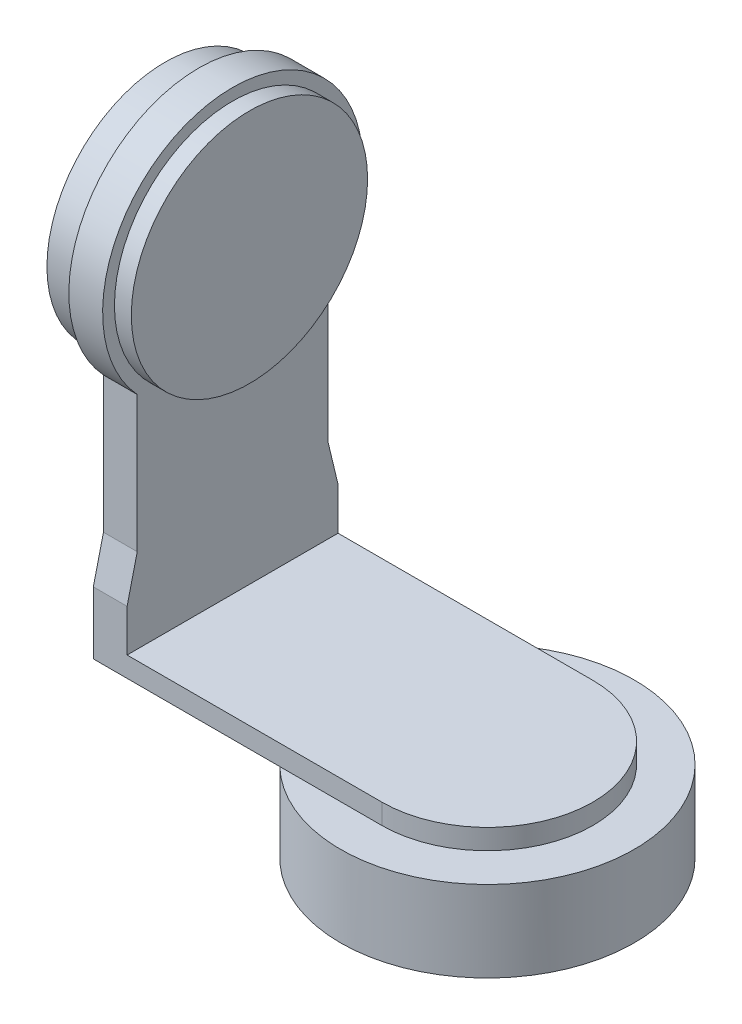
ISO-10303-21;
HEADER;
FILE_DESCRIPTION(('STEP AP214'),'2;1');
FILE_NAME('part.step','',(''),(''),'','','');
FILE_SCHEMA(('AUTOMOTIVE_DESIGN { 1 0 10303 214 1 1 1 1 }'));
ENDSEC;
DATA;
#1=APPLICATION_CONTEXT('core data for automotive mechanical design processes');
#2=APPLICATION_PROTOCOL_DEFINITION('international standard','automotive_design',2000,#1);
#3=PRODUCT_CONTEXT('',#1,'mechanical');
#4=PRODUCT('Part','Part','',(#3));
#5=PRODUCT_RELATED_PRODUCT_CATEGORY('part','',(#4));
#6=PRODUCT_DEFINITION_FORMATION('','',#4);
#7=PRODUCT_DEFINITION_CONTEXT('part definition',#1,'design');
#8=PRODUCT_DEFINITION('design','',#6,#7);
#9=PRODUCT_DEFINITION_SHAPE('','',#8);
#10=(LENGTH_UNIT() NAMED_UNIT(*) SI_UNIT(.MILLI.,.METRE.));
#11=(NAMED_UNIT(*) PLANE_ANGLE_UNIT() SI_UNIT($,.RADIAN.));
#12=(NAMED_UNIT(*) SI_UNIT($,.STERADIAN.) SOLID_ANGLE_UNIT());
#13=UNCERTAINTY_MEASURE_WITH_UNIT(LENGTH_MEASURE(1.E-05),#10,'distance_accuracy_value','');
#14=(GEOMETRIC_REPRESENTATION_CONTEXT(3) GLOBAL_UNCERTAINTY_ASSIGNED_CONTEXT((#13)) GLOBAL_UNIT_ASSIGNED_CONTEXT((#10,
#11,#12)) REPRESENTATION_CONTEXT('',''));
#15=CARTESIAN_POINT('',(0.,0.,0.));
#16=DIRECTION('',(0.,0.,1.));
#17=DIRECTION('',(1.,0.,0.));
#18=AXIS2_PLACEMENT_3D('',#15,#16,#17);
#19=CARTESIAN_POINT('',(0.,12.,0.));
#20=DIRECTION('',(0.,1.,0.));
#21=DIRECTION('',(0.,0.,1.));
#22=AXIS2_PLACEMENT_3D('',#19,#20,#21);
#23=PLANE('',#22);
#24=DIRECTION('',(-1.,0.,0.));
#25=VECTOR('',#24,1.);
#26=CARTESIAN_POINT('',(-34.2,12.,-12.5));
#27=LINE('',#26,#25);
#28=CARTESIAN_POINT('',(0.,12.,-12.5));
#29=VERTEX_POINT('',#28);
#30=CARTESIAN_POINT('',(-30.2,12.,-12.5));
#31=VERTEX_POINT('',#30);
#32=EDGE_CURVE('E183',#29,#31,#27,.T.);
#33=ORIENTED_EDGE('',*,*,#32,.T.);
#34=DIRECTION('',(0.,0.,1.));
#35=VECTOR('',#34,1.);
#36=CARTESIAN_POINT('',(-30.2,12.,12.5));
#37=LINE('',#36,#35);
#38=CARTESIAN_POINT('',(-30.2,12.,12.5));
#39=VERTEX_POINT('',#38);
#40=EDGE_CURVE('E154',#31,#39,#37,.T.);
#41=ORIENTED_EDGE('',*,*,#40,.T.);
#42=DIRECTION('',(1.,0.,0.));
#43=VECTOR('',#42,1.);
#44=CARTESIAN_POINT('',(0.,12.,12.5));
#45=LINE('',#44,#43);
#46=CARTESIAN_POINT('',(0.,12.,12.5));
#47=VERTEX_POINT('',#46);
#48=EDGE_CURVE('E187',#39,#47,#45,.T.);
#49=ORIENTED_EDGE('',*,*,#48,.T.);
#50=CARTESIAN_POINT('',(0.,12.,0.));
#51=DIRECTION('',(0.,1.,0.));
#52=DIRECTION('',(0.,0.,1.));
#53=AXIS2_PLACEMENT_3D('',#50,#51,#52);
#54=CIRCLE('',#53,12.5);
#55=EDGE_CURVE('E180',#47,#29,#54,.T.);
#56=ORIENTED_EDGE('',*,*,#55,.T.);
#57=EDGE_LOOP('',(#33,#41,#49,#56));
#58=FACE_BOUND('',#57,.T.);
#59=ADVANCED_FACE('F33',(#58),#23,.T.);
#60=CARTESIAN_POINT('',(0.,9.6,0.));
#61=DIRECTION('',(0.,-1.,0.));
#62=DIRECTION('',(0.,0.,-1.));
#63=AXIS2_PLACEMENT_3D('',#60,#61,#62);
#64=CYLINDRICAL_SURFACE('',#63,17.4);
#65=CARTESIAN_POINT('',(0.,9.6,0.));
#66=DIRECTION('',(0.,1.,0.));
#67=DIRECTION('',(0.,0.,1.));
#68=AXIS2_PLACEMENT_3D('',#65,#66,#67);
#69=CIRCLE('',#68,17.4);
#70=CARTESIAN_POINT('',(-12.1041315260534,9.6,-12.5));
#71=VERTEX_POINT('',#70);
#72=CARTESIAN_POINT('',(-12.1041315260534,9.6,12.5));
#73=VERTEX_POINT('',#72);
#74=EDGE_CURVE('E212',#71,#73,#69,.T.);
#75=ORIENTED_EDGE('',*,*,#74,.F.);
#76=EDGE_CURVE('E214',#73,#71,#69,.T.);
#77=ORIENTED_EDGE('',*,*,#76,.F.);
#78=EDGE_LOOP('',(#75,#77));
#79=FACE_BOUND('',#78,.T.);
#80=CARTESIAN_POINT('',(0.,0.,0.));
#81=DIRECTION('',(0.,1.,0.));
#82=DIRECTION('',(0.,0.,1.));
#83=AXIS2_PLACEMENT_3D('',#80,#81,#82);
#84=CIRCLE('',#83,17.4);
#85=CARTESIAN_POINT('',(0.,0.,17.4));
#86=VERTEX_POINT('',#85);
#87=EDGE_CURVE('E211',#86,#86,#84,.T.);
#88=ORIENTED_EDGE('',*,*,#87,.T.);
#89=EDGE_LOOP('',(#88));
#90=FACE_BOUND('',#89,.T.);
#91=ADVANCED_FACE('F35',(#79,#90),#64,.T.);
#92=CARTESIAN_POINT('',(0.,9.6,0.));
#93=DIRECTION('',(0.,1.,0.));
#94=DIRECTION('',(0.,0.,1.));
#95=AXIS2_PLACEMENT_3D('',#92,#93,#94);
#96=PLANE('',#95);
#97=DIRECTION('',(1.,0.,0.));
#98=VECTOR('',#97,1.);
#99=CARTESIAN_POINT('',(0.,9.6,12.5));
#100=LINE('',#99,#98);
#101=CARTESIAN_POINT('',(0.,9.6,12.5));
#102=VERTEX_POINT('',#101);
#103=EDGE_CURVE('E199',#73,#102,#100,.T.);
#104=ORIENTED_EDGE('',*,*,#103,.F.);
#105=ORIENTED_EDGE('',*,*,#76,.T.);
#106=DIRECTION('',(-1.,0.,0.));
#107=VECTOR('',#106,1.);
#108=CARTESIAN_POINT('',(-34.2,9.6,-12.5));
#109=LINE('',#108,#107);
#110=CARTESIAN_POINT('',(0.,9.6,-12.5));
#111=VERTEX_POINT('',#110);
#112=EDGE_CURVE('E192',#111,#71,#109,.T.);
#113=ORIENTED_EDGE('',*,*,#112,.F.);
#114=CARTESIAN_POINT('',(0.,9.6,0.));
#115=DIRECTION('',(0.,1.,0.));
#116=DIRECTION('',(0.,0.,1.));
#117=AXIS2_PLACEMENT_3D('',#114,#115,#116);
#118=CIRCLE('',#117,12.5);
#119=EDGE_CURVE('E56',#102,#111,#118,.T.);
#120=ORIENTED_EDGE('',*,*,#119,.F.);
#121=EDGE_LOOP('',(#104,#105,#113,#120));
#122=FACE_BOUND('',#121,.T.);
#123=ADVANCED_FACE('F221',(#122),#96,.T.);
#124=CARTESIAN_POINT('',(0.,0.,0.));
#125=DIRECTION('',(0.,1.,0.));
#126=DIRECTION('',(0.,0.,1.));
#127=AXIS2_PLACEMENT_3D('',#124,#125,#126);
#128=PLANE('',#127);
#129=ORIENTED_EDGE('',*,*,#87,.F.);
#130=EDGE_LOOP('',(#129));
#131=FACE_BOUND('',#130,.T.);
#132=ADVANCED_FACE('F266',(#131),#128,.F.);
#133=CARTESIAN_POINT('',(0.,9.6,0.));
#134=DIRECTION('',(0.,1.,0.));
#135=DIRECTION('',(0.,0.,1.));
#136=AXIS2_PLACEMENT_3D('',#133,#134,#135);
#137=PLANE('',#136);
#138=CARTESIAN_POINT('',(-34.2,9.6,-12.5));
#139=VERTEX_POINT('',#138);
#140=EDGE_CURVE('E191',#71,#139,#109,.T.);
#141=ORIENTED_EDGE('',*,*,#140,.F.);
#142=ORIENTED_EDGE('',*,*,#74,.T.);
#143=CARTESIAN_POINT('',(-34.2,9.6,12.5));
#144=VERTEX_POINT('',#143);
#145=EDGE_CURVE('E184',#144,#73,#100,.T.);
#146=ORIENTED_EDGE('',*,*,#145,.F.);
#147=DIRECTION('',(0.,0.,1.));
#148=VECTOR('',#147,1.);
#149=CARTESIAN_POINT('',(-34.2,9.6,12.5));
#150=LINE('',#149,#148);
#151=EDGE_CURVE('E195',#139,#144,#150,.T.);
#152=ORIENTED_EDGE('',*,*,#151,.F.);
#153=EDGE_LOOP('',(#141,#142,#146,#152));
#154=FACE_BOUND('',#153,.T.);
#155=ADVANCED_FACE('F225',(#154),#137,.F.);
#156=CARTESIAN_POINT('',(0.,12.,0.));
#157=DIRECTION('',(0.,-1.,0.));
#158=DIRECTION('',(0.,0.,-1.));
#159=AXIS2_PLACEMENT_3D('',#156,#157,#158);
#160=CYLINDRICAL_SURFACE('',#159,12.5);
#161=ORIENTED_EDGE('',*,*,#119,.T.);
#162=DIRECTION('',(0.,-1.,0.));
#163=VECTOR('',#162,1.);
#164=CARTESIAN_POINT('',(0.,12.,-12.5));
#165=LINE('',#164,#163);
#166=EDGE_CURVE('E208',#29,#111,#165,.T.);
#167=ORIENTED_EDGE('',*,*,#166,.F.);
#168=ORIENTED_EDGE('',*,*,#55,.F.);
#169=DIRECTION('',(0.,-1.,0.));
#170=VECTOR('',#169,1.);
#171=CARTESIAN_POINT('',(0.,12.,12.5));
#172=LINE('',#171,#170);
#173=EDGE_CURVE('E189',#47,#102,#172,.T.);
#174=ORIENTED_EDGE('',*,*,#173,.T.);
#175=EDGE_LOOP('',(#161,#167,#168,#174));
#176=FACE_BOUND('',#175,.T.);
#177=ADVANCED_FACE('F232',(#176),#160,.T.);
#178=CARTESIAN_POINT('',(-34.2,12.,-12.5));
#179=DIRECTION('',(0.,0.,1.));
#180=DIRECTION('',(1.,0.,0.));
#181=AXIS2_PLACEMENT_3D('',#178,#179,#180);
#182=PLANE('',#181);
#183=ORIENTED_EDGE('',*,*,#112,.T.);
#184=ORIENTED_EDGE('',*,*,#140,.T.);
#185=DIRECTION('',(0.,-1.,0.));
#186=VECTOR('',#185,1.);
#187=CARTESIAN_POINT('',(-34.2,12.,-12.5));
#188=LINE('',#187,#186);
#189=CARTESIAN_POINT('',(-34.2,17.,-12.5));
#190=VERTEX_POINT('',#189);
#191=EDGE_CURVE('E205',#190,#139,#188,.T.);
#192=ORIENTED_EDGE('',*,*,#191,.F.);
#193=DIRECTION('',(-1.,0.,0.));
#194=VECTOR('',#193,1.);
#195=CARTESIAN_POINT('',(-30.2,17.,-12.5));
#196=LINE('',#195,#194);
#197=CARTESIAN_POINT('',(-30.2,17.,-12.5));
#198=VERTEX_POINT('',#197);
#199=EDGE_CURVE('E176',#198,#190,#196,.T.);
#200=ORIENTED_EDGE('',*,*,#199,.F.);
#201=DIRECTION('',(0.,-1.,0.));
#202=VECTOR('',#201,1.);
#203=CARTESIAN_POINT('',(-30.2,12.,-12.5));
#204=LINE('',#203,#202);
#205=EDGE_CURVE('E151',#198,#31,#204,.T.);
#206=ORIENTED_EDGE('',*,*,#205,.T.);
#207=ORIENTED_EDGE('',*,*,#32,.F.);
#208=ORIENTED_EDGE('',*,*,#166,.T.);
#209=EDGE_LOOP('',(#183,#184,#192,#200,#206,#207,#208));
#210=FACE_BOUND('',#209,.T.);
#211=ADVANCED_FACE('F228',(#210),#182,.F.);
#212=CARTESIAN_POINT('',(-34.2,12.,12.5));
#213=DIRECTION('',(1.,0.,0.));
#214=DIRECTION('',(0.,0.,-1.));
#215=AXIS2_PLACEMENT_3D('',#212,#213,#214);
#216=PLANE('',#215);
#217=CARTESIAN_POINT('',(-34.2,48.6,0.));
#218=DIRECTION('',(-1.,0.,0.));
#219=DIRECTION('',(0.,0.,1.));
#220=AXIS2_PLACEMENT_3D('',#217,#218,#219);
#221=CIRCLE('',#220,14.);
#222=CARTESIAN_POINT('',(-34.2,48.6,14.));
#223=VERTEX_POINT('',#222);
#224=EDGE_CURVE('E41',#223,#223,#221,.T.);
#225=ORIENTED_EDGE('',*,*,#224,.F.);
#226=EDGE_LOOP('',(#225));
#227=FACE_BOUND('',#226,.T.);
#228=ORIENTED_EDGE('',*,*,#151,.T.);
#229=DIRECTION('',(0.,-1.,0.));
#230=VECTOR('',#229,1.);
#231=CARTESIAN_POINT('',(-34.2,12.,12.5));
#232=LINE('',#231,#230);
#233=CARTESIAN_POINT('',(-34.2,17.,12.5));
#234=VERTEX_POINT('',#233);
#235=EDGE_CURVE('E202',#234,#144,#232,.T.);
#236=ORIENTED_EDGE('',*,*,#235,.F.);
#237=DIRECTION('',(0.,0.972387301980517,-0.233372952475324));
#238=VECTOR('',#237,1.);
#239=CARTESIAN_POINT('',(-34.2,17.,12.5));
#240=LINE('',#239,#238);
#241=CARTESIAN_POINT('',(-34.2,22.,11.3));
#242=VERTEX_POINT('',#241);
#243=EDGE_CURVE('E145',#234,#242,#240,.T.);
#244=ORIENTED_EDGE('',*,*,#243,.T.);
#245=DIRECTION('',(0.,1.,0.));
#246=VECTOR('',#245,1.);
#247=CARTESIAN_POINT('',(-34.2,22.,11.3));
#248=LINE('',#247,#246);
#249=CARTESIAN_POINT('',(-34.2,38.1372087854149,11.3));
#250=VERTEX_POINT('',#249);
#251=EDGE_CURVE('E142',#242,#250,#248,.T.);
#252=ORIENTED_EDGE('',*,*,#251,.T.);
#253=CARTESIAN_POINT('',(-34.2,48.6,0.));
#254=DIRECTION('',(-1.,0.,0.));
#255=DIRECTION('',(0.,0.,1.));
#256=AXIS2_PLACEMENT_3D('',#253,#254,#255);
#257=CIRCLE('',#256,15.4);
#258=CARTESIAN_POINT('',(-34.2,38.1372087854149,-11.3));
#259=VERTEX_POINT('',#258);
#260=EDGE_CURVE('E161',#250,#259,#257,.T.);
#261=ORIENTED_EDGE('',*,*,#260,.T.);
#262=DIRECTION('',(0.,-1.,0.));
#263=VECTOR('',#262,1.);
#264=CARTESIAN_POINT('',(-34.2,22.,-11.3));
#265=LINE('',#264,#263);
#266=CARTESIAN_POINT('',(-34.2,22.,-11.3));
#267=VERTEX_POINT('',#266);
#268=EDGE_CURVE('E122',#259,#267,#265,.T.);
#269=ORIENTED_EDGE('',*,*,#268,.T.);
#270=DIRECTION('',(0.,-0.972387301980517,-0.233372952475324));
#271=VECTOR('',#270,1.);
#272=CARTESIAN_POINT('',(-34.2,17.,-12.5));
#273=LINE('',#272,#271);
#274=EDGE_CURVE('E165',#267,#190,#273,.T.);
#275=ORIENTED_EDGE('',*,*,#274,.T.);
#276=ORIENTED_EDGE('',*,*,#191,.T.);
#277=EDGE_LOOP('',(#228,#236,#244,#252,#261,#269,#275,#276));
#278=FACE_BOUND('',#277,.T.);
#279=ADVANCED_FACE('F242',(#227,#278),#216,.F.);
#280=CARTESIAN_POINT('',(0.,12.,12.5));
#281=DIRECTION('',(0.,0.,-1.));
#282=DIRECTION('',(-1.,0.,0.));
#283=AXIS2_PLACEMENT_3D('',#280,#281,#282);
#284=PLANE('',#283);
#285=ORIENTED_EDGE('',*,*,#145,.T.);
#286=ORIENTED_EDGE('',*,*,#103,.T.);
#287=ORIENTED_EDGE('',*,*,#173,.F.);
#288=ORIENTED_EDGE('',*,*,#48,.F.);
#289=DIRECTION('',(0.,1.,0.));
#290=VECTOR('',#289,1.);
#291=CARTESIAN_POINT('',(-30.2,12.,12.5));
#292=LINE('',#291,#290);
#293=CARTESIAN_POINT('',(-30.2,17.,12.5));
#294=VERTEX_POINT('',#293);
#295=EDGE_CURVE('E48',#39,#294,#292,.T.);
#296=ORIENTED_EDGE('',*,*,#295,.T.);
#297=DIRECTION('',(-1.,0.,0.));
#298=VECTOR('',#297,1.);
#299=CARTESIAN_POINT('',(-30.2,17.,12.5));
#300=LINE('',#299,#298);
#301=EDGE_CURVE('E173',#294,#234,#300,.T.);
#302=ORIENTED_EDGE('',*,*,#301,.T.);
#303=ORIENTED_EDGE('',*,*,#235,.T.);
#304=EDGE_LOOP('',(#285,#286,#287,#288,#296,#302,#303));
#305=FACE_BOUND('',#304,.T.);
#306=ADVANCED_FACE('F236',(#305),#284,.F.);
#307=CARTESIAN_POINT('',(-30.2,48.6,0.));
#308=DIRECTION('',(-1.,0.,0.));
#309=DIRECTION('',(0.,0.,1.));
#310=AXIS2_PLACEMENT_3D('',#307,#308,#309);
#311=CYLINDRICAL_SURFACE('',#310,15.4);
#312=ORIENTED_EDGE('',*,*,#260,.F.);
#313=DIRECTION('',(-1.,0.,0.));
#314=VECTOR('',#313,1.);
#315=CARTESIAN_POINT('',(-30.2,38.1372087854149,11.3));
#316=LINE('',#315,#314);
#317=CARTESIAN_POINT('',(-30.2,38.1372087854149,11.3));
#318=VERTEX_POINT('',#317);
#319=EDGE_CURVE('E141',#318,#250,#316,.T.);
#320=ORIENTED_EDGE('',*,*,#319,.F.);
#321=CARTESIAN_POINT('',(-30.2,48.6,0.));
#322=DIRECTION('',(-1.,0.,0.));
#323=DIRECTION('',(0.,0.,1.));
#324=AXIS2_PLACEMENT_3D('',#321,#322,#323);
#325=CIRCLE('',#324,15.4);
#326=CARTESIAN_POINT('',(-30.2,38.1372087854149,-11.3));
#327=VERTEX_POINT('',#326);
#328=EDGE_CURVE('E134',#318,#327,#325,.T.);
#329=ORIENTED_EDGE('',*,*,#328,.T.);
#330=DIRECTION('',(-1.,0.,0.));
#331=VECTOR('',#330,1.);
#332=CARTESIAN_POINT('',(-30.2,38.1372087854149,-11.3));
#333=LINE('',#332,#331);
#334=EDGE_CURVE('E117',#327,#259,#333,.T.);
#335=ORIENTED_EDGE('',*,*,#334,.T.);
#336=EDGE_LOOP('',(#312,#320,#329,#335));
#337=FACE_BOUND('',#336,.T.);
#338=ADVANCED_FACE('F140',(#337),#311,.T.);
#339=CARTESIAN_POINT('',(-30.2,22.,11.3));
#340=DIRECTION('',(0.,0.,1.));
#341=DIRECTION('',(1.,0.,0.));
#342=AXIS2_PLACEMENT_3D('',#339,#340,#341);
#343=PLANE('',#342);
#344=ORIENTED_EDGE('',*,*,#251,.F.);
#345=DIRECTION('',(-1.,0.,0.));
#346=VECTOR('',#345,1.);
#347=CARTESIAN_POINT('',(-30.2,22.,11.3));
#348=LINE('',#347,#346);
#349=CARTESIAN_POINT('',(-30.2,22.,11.3));
#350=VERTEX_POINT('',#349);
#351=EDGE_CURVE('E171',#350,#242,#348,.T.);
#352=ORIENTED_EDGE('',*,*,#351,.F.);
#353=DIRECTION('',(0.,1.,0.));
#354=VECTOR('',#353,1.);
#355=CARTESIAN_POINT('',(-30.2,22.,11.3));
#356=LINE('',#355,#354);
#357=EDGE_CURVE('E128',#350,#318,#356,.T.);
#358=ORIENTED_EDGE('',*,*,#357,.T.);
#359=ORIENTED_EDGE('',*,*,#319,.T.);
#360=EDGE_LOOP('',(#344,#352,#358,#359));
#361=FACE_BOUND('',#360,.T.);
#362=ADVANCED_FACE('F251',(#361),#343,.T.);
#363=CARTESIAN_POINT('',(-30.2,17.,12.5));
#364=DIRECTION('',(0.,0.233372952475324,0.972387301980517));
#365=DIRECTION('',(0.,-0.972387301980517,0.233372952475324));
#366=AXIS2_PLACEMENT_3D('',#363,#364,#365);
#367=PLANE('',#366);
#368=ORIENTED_EDGE('',*,*,#243,.F.);
#369=ORIENTED_EDGE('',*,*,#301,.F.);
#370=DIRECTION('',(0.,0.972387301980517,-0.233372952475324));
#371=VECTOR('',#370,1.);
#372=CARTESIAN_POINT('',(-30.2,17.,12.5));
#373=LINE('',#372,#371);
#374=EDGE_CURVE('E157',#294,#350,#373,.T.);
#375=ORIENTED_EDGE('',*,*,#374,.T.);
#376=ORIENTED_EDGE('',*,*,#351,.T.);
#377=EDGE_LOOP('',(#368,#369,#375,#376));
#378=FACE_BOUND('',#377,.T.);
#379=ADVANCED_FACE('F248',(#378),#367,.T.);
#380=CARTESIAN_POINT('',(-30.2,17.,-12.5));
#381=DIRECTION('',(0.,0.233372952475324,-0.972387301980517));
#382=DIRECTION('',(0.,0.972387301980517,0.233372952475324));
#383=AXIS2_PLACEMENT_3D('',#380,#381,#382);
#384=PLANE('',#383);
#385=ORIENTED_EDGE('',*,*,#274,.F.);
#386=DIRECTION('',(-1.,0.,0.));
#387=VECTOR('',#386,1.);
#388=CARTESIAN_POINT('',(-30.2,22.,-11.3));
#389=LINE('',#388,#387);
#390=CARTESIAN_POINT('',(-30.2,22.,-11.3));
#391=VERTEX_POINT('',#390);
#392=EDGE_CURVE('E127',#391,#267,#389,.T.);
#393=ORIENTED_EDGE('',*,*,#392,.F.);
#394=DIRECTION('',(0.,-0.972387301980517,-0.233372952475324));
#395=VECTOR('',#394,1.);
#396=CARTESIAN_POINT('',(-30.2,17.,-12.5));
#397=LINE('',#396,#395);
#398=EDGE_CURVE('E138',#391,#198,#397,.T.);
#399=ORIENTED_EDGE('',*,*,#398,.T.);
#400=ORIENTED_EDGE('',*,*,#199,.T.);
#401=EDGE_LOOP('',(#385,#393,#399,#400));
#402=FACE_BOUND('',#401,.T.);
#403=ADVANCED_FACE('F254',(#402),#384,.T.);
#404=CARTESIAN_POINT('',(-30.2,22.,-11.3));
#405=DIRECTION('',(0.,0.,-1.));
#406=DIRECTION('',(-1.,0.,0.));
#407=AXIS2_PLACEMENT_3D('',#404,#405,#406);
#408=PLANE('',#407);
#409=ORIENTED_EDGE('',*,*,#268,.F.);
#410=ORIENTED_EDGE('',*,*,#334,.F.);
#411=DIRECTION('',(0.,-1.,0.));
#412=VECTOR('',#411,1.);
#413=CARTESIAN_POINT('',(-30.2,22.,-11.3));
#414=LINE('',#413,#412);
#415=EDGE_CURVE('E120',#327,#391,#414,.T.);
#416=ORIENTED_EDGE('',*,*,#415,.T.);
#417=ORIENTED_EDGE('',*,*,#392,.T.);
#418=EDGE_LOOP('',(#409,#410,#416,#417));
#419=FACE_BOUND('',#418,.T.);
#420=ADVANCED_FACE('F119',(#419),#408,.T.);
#421=CARTESIAN_POINT('',(-30.2,48.6,0.));
#422=DIRECTION('',(-1.,0.,0.));
#423=DIRECTION('',(0.,0.,1.));
#424=AXIS2_PLACEMENT_3D('',#421,#422,#423);
#425=PLANE('',#424);
#426=CARTESIAN_POINT('',(-30.2,48.6,0.));
#427=DIRECTION('',(-1.,0.,0.));
#428=DIRECTION('',(0.,0.,1.));
#429=AXIS2_PLACEMENT_3D('',#426,#427,#428);
#430=CIRCLE('',#429,14.);
#431=CARTESIAN_POINT('',(-30.2,48.6,14.));
#432=VERTEX_POINT('',#431);
#433=EDGE_CURVE('E11',#432,#432,#430,.F.);
#434=ORIENTED_EDGE('',*,*,#433,.F.);
#435=EDGE_LOOP('',(#434));
#436=FACE_BOUND('',#435,.T.);
#437=ORIENTED_EDGE('',*,*,#328,.F.);
#438=ORIENTED_EDGE('',*,*,#357,.F.);
#439=ORIENTED_EDGE('',*,*,#374,.F.);
#440=ORIENTED_EDGE('',*,*,#295,.F.);
#441=ORIENTED_EDGE('',*,*,#40,.F.);
#442=ORIENTED_EDGE('',*,*,#205,.F.);
#443=ORIENTED_EDGE('',*,*,#398,.F.);
#444=ORIENTED_EDGE('',*,*,#415,.F.);
#445=EDGE_LOOP('',(#437,#438,#439,#440,#441,#442,#443,#444));
#446=FACE_BOUND('',#445,.T.);
#447=ADVANCED_FACE('F132',(#436,#446),#425,.F.);
#448=CARTESIAN_POINT('',(-38.2,48.6,0.));
#449=DIRECTION('',(1.,0.,0.));
#450=DIRECTION('',(0.,0.,-1.));
#451=AXIS2_PLACEMENT_3D('',#448,#449,#450);
#452=CYLINDRICAL_SURFACE('',#451,14.);
#453=CARTESIAN_POINT('',(-38.2,48.6,0.));
#454=DIRECTION('',(-1.,0.,0.));
#455=DIRECTION('',(0.,0.,1.));
#456=AXIS2_PLACEMENT_3D('',#453,#454,#455);
#457=CIRCLE('',#456,14.);
#458=CARTESIAN_POINT('',(-38.2,48.6,14.));
#459=VERTEX_POINT('',#458);
#460=EDGE_CURVE('E163',#459,#459,#457,.T.);
#461=ORIENTED_EDGE('',*,*,#460,.F.);
#462=EDGE_LOOP('',(#461));
#463=FACE_BOUND('',#462,.T.);
#464=ORIENTED_EDGE('',*,*,#224,.T.);
#465=EDGE_LOOP('',(#464));
#466=FACE_BOUND('',#465,.T.);
#467=ADVANCED_FACE('F240',(#463,#466),#452,.T.);
#468=CARTESIAN_POINT('',(-38.2,48.6,0.));
#469=DIRECTION('',(-1.,0.,0.));
#470=DIRECTION('',(0.,0.,1.));
#471=AXIS2_PLACEMENT_3D('',#468,#469,#470);
#472=PLANE('',#471);
#473=ORIENTED_EDGE('',*,*,#460,.T.);
#474=EDGE_LOOP('',(#473));
#475=FACE_BOUND('',#474,.T.);
#476=ADVANCED_FACE('F344',(#475),#472,.T.);
#477=CARTESIAN_POINT('',(-28.2,48.6,0.));
#478=DIRECTION('',(-1.,0.,0.));
#479=DIRECTION('',(0.,0.,1.));
#480=AXIS2_PLACEMENT_3D('',#477,#478,#479);
#481=CYLINDRICAL_SURFACE('',#480,14.);
#482=CARTESIAN_POINT('',(-28.2,48.6,0.));
#483=DIRECTION('',(1.,0.,0.));
#484=DIRECTION('',(0.,0.,-1.));
#485=AXIS2_PLACEMENT_3D('',#482,#483,#484);
#486=CIRCLE('',#485,14.);
#487=CARTESIAN_POINT('',(-28.2,48.6,-14.));
#488=VERTEX_POINT('',#487);
#489=EDGE_CURVE('E425',#488,#488,#486,.T.);
#490=ORIENTED_EDGE('',*,*,#489,.F.);
#491=EDGE_LOOP('',(#490));
#492=FACE_BOUND('',#491,.T.);
#493=ORIENTED_EDGE('',*,*,#433,.T.);
#494=EDGE_LOOP('',(#493));
#495=FACE_BOUND('',#494,.T.);
#496=ADVANCED_FACE('F351',(#492,#495),#481,.T.);
#497=CARTESIAN_POINT('',(-28.2,48.6,0.));
#498=DIRECTION('',(1.,0.,0.));
#499=DIRECTION('',(0.,0.,-1.));
#500=AXIS2_PLACEMENT_3D('',#497,#498,#499);
#501=PLANE('',#500);
#502=ORIENTED_EDGE('',*,*,#489,.T.);
#503=EDGE_LOOP('',(#502));
#504=FACE_BOUND('',#503,.T.);
#505=ADVANCED_FACE('F358',(#504),#501,.T.);
#506=CLOSED_SHELL('',(#59,#91,#123,#132,#155,#177,#211,#279,#306,#338,#362,#379,#403,#420,#447,
#467,#476,#496,#505));
#507=MANIFOLD_SOLID_BREP('B2',#506);
#508=ADVANCED_BREP_SHAPE_REPRESENTATION('',(#18,#507),#14);
#509=SHAPE_DEFINITION_REPRESENTATION(#9,#508);
ENDSEC;
END-ISO-10303-21;
